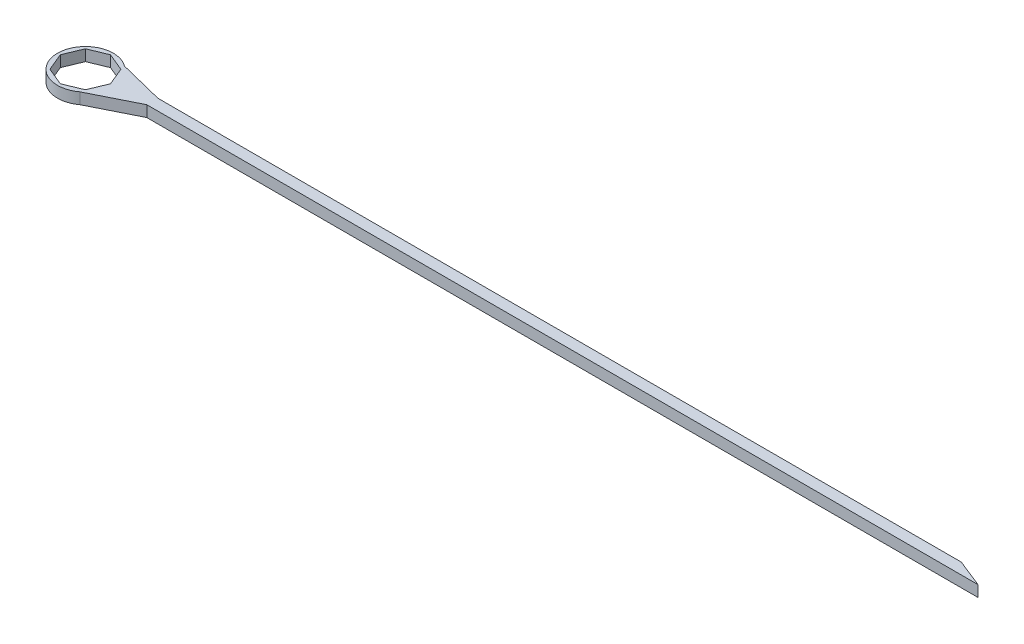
ISO-10303-21;
HEADER;
FILE_DESCRIPTION(('STEP AP214'),'2;1');
FILE_NAME('part.step','',(''),(''),'','','');
FILE_SCHEMA(('AUTOMOTIVE_DESIGN { 1 0 10303 214 1 1 1 1 }'));
ENDSEC;
DATA;
#1=APPLICATION_CONTEXT('core data for automotive mechanical design processes');
#2=APPLICATION_PROTOCOL_DEFINITION('international standard','automotive_design',2000,#1);
#3=PRODUCT_CONTEXT('',#1,'mechanical');
#4=PRODUCT('Part','Part','',(#3));
#5=PRODUCT_RELATED_PRODUCT_CATEGORY('part','',(#4));
#6=PRODUCT_DEFINITION_FORMATION('','',#4);
#7=PRODUCT_DEFINITION_CONTEXT('part definition',#1,'design');
#8=PRODUCT_DEFINITION('design','',#6,#7);
#9=PRODUCT_DEFINITION_SHAPE('','',#8);
#10=(LENGTH_UNIT() NAMED_UNIT(*) SI_UNIT(.MILLI.,.METRE.));
#11=(NAMED_UNIT(*) PLANE_ANGLE_UNIT() SI_UNIT($,.RADIAN.));
#12=(NAMED_UNIT(*) SI_UNIT($,.STERADIAN.) SOLID_ANGLE_UNIT());
#13=UNCERTAINTY_MEASURE_WITH_UNIT(LENGTH_MEASURE(1.E-05),#10,'distance_accuracy_value','');
#14=(GEOMETRIC_REPRESENTATION_CONTEXT(3) GLOBAL_UNCERTAINTY_ASSIGNED_CONTEXT((#13)) GLOBAL_UNIT_ASSIGNED_CONTEXT((#10,
#11,#12)) REPRESENTATION_CONTEXT('',''));
#15=CARTESIAN_POINT('',(0.,0.,0.));
#16=DIRECTION('',(0.,0.,1.));
#17=DIRECTION('',(1.,0.,0.));
#18=AXIS2_PLACEMENT_3D('',#15,#16,#17);
#19=CARTESIAN_POINT('',(0.,1.,0.));
#20=DIRECTION('',(0.,1.,0.));
#21=DIRECTION('',(0.,0.,1.));
#22=AXIS2_PLACEMENT_3D('',#19,#20,#21);
#23=PLANE('',#22);
#24=DIRECTION('',(0.894427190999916,0.,-0.447213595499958));
#25=VECTOR('',#24,1.);
#26=CARTESIAN_POINT('',(5.5,1.,0.));
#27=LINE('',#26,#25);
#28=CARTESIAN_POINT('',(1.5,1.,2.));
#29=VERTEX_POINT('',#28);
#30=CARTESIAN_POINT('',(5.5,1.,0.));
#31=VERTEX_POINT('',#30);
#32=EDGE_CURVE('E198',#29,#31,#27,.T.);
#33=ORIENTED_EDGE('',*,*,#32,.T.);
#34=DIRECTION('',(1.,0.,0.));
#35=VECTOR('',#34,1.);
#36=CARTESIAN_POINT('',(5.5,1.,0.));
#37=LINE('',#36,#35);
#38=CARTESIAN_POINT('',(80.,1.,0.));
#39=VERTEX_POINT('',#38);
#40=EDGE_CURVE('E201',#31,#39,#37,.T.);
#41=ORIENTED_EDGE('',*,*,#40,.T.);
#42=DIRECTION('',(-0.928476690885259,0.,-0.371390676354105));
#43=VECTOR('',#42,1.);
#44=CARTESIAN_POINT('',(80.,1.,0.));
#45=LINE('',#44,#43);
#46=CARTESIAN_POINT('',(77.5,1.,-1.00000000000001));
#47=VERTEX_POINT('',#46);
#48=EDGE_CURVE('E204',#39,#47,#45,.T.);
#49=ORIENTED_EDGE('',*,*,#48,.T.);
#50=DIRECTION('',(-1.,0.,0.));
#51=VECTOR('',#50,1.);
#52=CARTESIAN_POINT('',(77.5,1.,-1.00000000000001));
#53=LINE('',#52,#51);
#54=CARTESIAN_POINT('',(5.5,1.,-0.999999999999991));
#55=VERTEX_POINT('',#54);
#56=EDGE_CURVE('E206',#47,#55,#53,.T.);
#57=ORIENTED_EDGE('',*,*,#56,.T.);
#58=DIRECTION('',(-0.970142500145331,0.,-0.242535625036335));
#59=VECTOR('',#58,1.);
#60=CARTESIAN_POINT('',(5.5,1.,-0.999999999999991));
#61=LINE('',#60,#59);
#62=CARTESIAN_POINT('',(1.5,1.,-2.));
#63=VERTEX_POINT('',#62);
#64=EDGE_CURVE('E208',#55,#63,#61,.T.);
#65=ORIENTED_EDGE('',*,*,#64,.T.);
#66=CARTESIAN_POINT('',(0.,1.,0.));
#67=DIRECTION('',(0.,1.,0.));
#68=DIRECTION('',(0.,0.,1.));
#69=AXIS2_PLACEMENT_3D('',#66,#67,#68);
#70=CIRCLE('',#69,2.5);
#71=EDGE_CURVE('E210',#63,#29,#70,.T.);
#72=ORIENTED_EDGE('',*,*,#71,.T.);
#73=EDGE_LOOP('',(#33,#41,#49,#57,#65,#72));
#74=FACE_BOUND('',#73,.T.);
#75=DIRECTION('',(-0.382683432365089,0.,-0.923879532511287));
#76=VECTOR('',#75,1.);
#77=CARTESIAN_POINT('',(2.25,1.,0.));
#78=LINE('',#77,#76);
#79=CARTESIAN_POINT('',(2.25,1.,0.));
#80=VERTEX_POINT('',#79);
#81=CARTESIAN_POINT('',(1.59099025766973,1.,-1.59099025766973));
#82=VERTEX_POINT('',#81);
#83=EDGE_CURVE('E141',#80,#82,#78,.T.);
#84=ORIENTED_EDGE('',*,*,#83,.F.);
#85=DIRECTION('',(0.38268343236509,0.,-0.923879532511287));
#86=VECTOR('',#85,1.);
#87=CARTESIAN_POINT('',(1.59099025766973,1.,1.59099025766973));
#88=LINE('',#87,#86);
#89=CARTESIAN_POINT('',(1.59099025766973,1.,1.59099025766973));
#90=VERTEX_POINT('',#89);
#91=EDGE_CURVE('E133',#90,#80,#88,.T.);
#92=ORIENTED_EDGE('',*,*,#91,.F.);
#93=DIRECTION('',(0.923879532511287,0.,-0.382683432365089));
#94=VECTOR('',#93,1.);
#95=CARTESIAN_POINT('',(0.,1.,2.25));
#96=LINE('',#95,#94);
#97=CARTESIAN_POINT('',(0.,1.,2.25));
#98=VERTEX_POINT('',#97);
#99=EDGE_CURVE('E166',#98,#90,#96,.T.);
#100=ORIENTED_EDGE('',*,*,#99,.F.);
#101=DIRECTION('',(0.923879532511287,0.,0.38268343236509));
#102=VECTOR('',#101,1.);
#103=CARTESIAN_POINT('',(-1.59099025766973,1.,1.59099025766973));
#104=LINE('',#103,#102);
#105=CARTESIAN_POINT('',(-1.59099025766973,1.,1.59099025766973));
#106=VERTEX_POINT('',#105);
#107=EDGE_CURVE('E164',#106,#98,#104,.T.);
#108=ORIENTED_EDGE('',*,*,#107,.F.);
#109=DIRECTION('',(0.38268343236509,0.,0.923879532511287));
#110=VECTOR('',#109,1.);
#111=CARTESIAN_POINT('',(-2.25,1.,0.));
#112=LINE('',#111,#110);
#113=CARTESIAN_POINT('',(-2.25,1.,0.));
#114=VERTEX_POINT('',#113);
#115=EDGE_CURVE('E162',#114,#106,#112,.T.);
#116=ORIENTED_EDGE('',*,*,#115,.F.);
#117=DIRECTION('',(-0.38268343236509,0.,0.923879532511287));
#118=VECTOR('',#117,1.);
#119=CARTESIAN_POINT('',(-1.59099025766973,1.,-1.59099025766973));
#120=LINE('',#119,#118);
#121=CARTESIAN_POINT('',(-1.59099025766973,1.,-1.59099025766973));
#122=VERTEX_POINT('',#121);
#123=EDGE_CURVE('E160',#122,#114,#120,.T.);
#124=ORIENTED_EDGE('',*,*,#123,.F.);
#125=DIRECTION('',(-0.923879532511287,0.,0.382683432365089));
#126=VECTOR('',#125,1.);
#127=CARTESIAN_POINT('',(0.,1.,-2.25));
#128=LINE('',#127,#126);
#129=CARTESIAN_POINT('',(0.,1.,-2.25));
#130=VERTEX_POINT('',#129);
#131=EDGE_CURVE('E156',#130,#122,#128,.T.);
#132=ORIENTED_EDGE('',*,*,#131,.F.);
#133=DIRECTION('',(-0.923879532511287,0.,-0.38268343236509));
#134=VECTOR('',#133,1.);
#135=CARTESIAN_POINT('',(1.59099025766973,1.,-1.59099025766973));
#136=LINE('',#135,#134);
#137=EDGE_CURVE('E154',#82,#130,#136,.T.);
#138=ORIENTED_EDGE('',*,*,#137,.F.);
#139=EDGE_LOOP('',(#84,#92,#100,#108,#116,#124,#132,#138));
#140=FACE_BOUND('',#139,.T.);
#141=ADVANCED_FACE('F32',(#74,#140),#23,.T.);
#142=CARTESIAN_POINT('',(0.,0.,0.));
#143=DIRECTION('',(0.,1.,0.));
#144=DIRECTION('',(0.,0.,1.));
#145=AXIS2_PLACEMENT_3D('',#142,#143,#144);
#146=PLANE('',#145);
#147=DIRECTION('',(0.894427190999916,0.,-0.447213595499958));
#148=VECTOR('',#147,1.);
#149=CARTESIAN_POINT('',(5.5,0.,0.));
#150=LINE('',#149,#148);
#151=CARTESIAN_POINT('',(1.5,0.,2.));
#152=VERTEX_POINT('',#151);
#153=CARTESIAN_POINT('',(5.5,0.,0.));
#154=VERTEX_POINT('',#153);
#155=EDGE_CURVE('E149',#152,#154,#150,.T.);
#156=ORIENTED_EDGE('',*,*,#155,.F.);
#157=CARTESIAN_POINT('',(0.,0.,0.));
#158=DIRECTION('',(0.,1.,0.));
#159=DIRECTION('',(0.,0.,1.));
#160=AXIS2_PLACEMENT_3D('',#157,#158,#159);
#161=CIRCLE('',#160,2.5);
#162=CARTESIAN_POINT('',(1.5,0.,-2.));
#163=VERTEX_POINT('',#162);
#164=EDGE_CURVE('E202',#163,#152,#161,.T.);
#165=ORIENTED_EDGE('',*,*,#164,.F.);
#166=DIRECTION('',(-0.970142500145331,0.,-0.242535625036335));
#167=VECTOR('',#166,1.);
#168=CARTESIAN_POINT('',(5.5,0.,-0.999999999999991));
#169=LINE('',#168,#167);
#170=CARTESIAN_POINT('',(5.5,0.,-0.999999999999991));
#171=VERTEX_POINT('',#170);
#172=EDGE_CURVE('E221',#171,#163,#169,.T.);
#173=ORIENTED_EDGE('',*,*,#172,.F.);
#174=DIRECTION('',(-1.,0.,0.));
#175=VECTOR('',#174,1.);
#176=CARTESIAN_POINT('',(77.5,0.,-1.00000000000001));
#177=LINE('',#176,#175);
#178=CARTESIAN_POINT('',(77.5,0.,-1.00000000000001));
#179=VERTEX_POINT('',#178);
#180=EDGE_CURVE('E219',#179,#171,#177,.T.);
#181=ORIENTED_EDGE('',*,*,#180,.F.);
#182=DIRECTION('',(-0.928476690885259,0.,-0.371390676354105));
#183=VECTOR('',#182,1.);
#184=CARTESIAN_POINT('',(80.,0.,0.));
#185=LINE('',#184,#183);
#186=CARTESIAN_POINT('',(80.,0.,0.));
#187=VERTEX_POINT('',#186);
#188=EDGE_CURVE('E217',#187,#179,#185,.T.);
#189=ORIENTED_EDGE('',*,*,#188,.F.);
#190=DIRECTION('',(1.,0.,0.));
#191=VECTOR('',#190,1.);
#192=CARTESIAN_POINT('',(5.5,0.,0.));
#193=LINE('',#192,#191);
#194=EDGE_CURVE('E215',#154,#187,#193,.T.);
#195=ORIENTED_EDGE('',*,*,#194,.F.);
#196=EDGE_LOOP('',(#156,#165,#173,#181,#189,#195));
#197=FACE_BOUND('',#196,.T.);
#198=DIRECTION('',(0.38268343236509,0.,-0.923879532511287));
#199=VECTOR('',#198,1.);
#200=CARTESIAN_POINT('',(1.59099025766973,0.,1.59099025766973));
#201=LINE('',#200,#199);
#202=CARTESIAN_POINT('',(1.59099025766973,0.,1.59099025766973));
#203=VERTEX_POINT('',#202);
#204=CARTESIAN_POINT('',(2.25,0.,0.));
#205=VERTEX_POINT('',#204);
#206=EDGE_CURVE('E55',#203,#205,#201,.T.);
#207=ORIENTED_EDGE('',*,*,#206,.T.);
#208=DIRECTION('',(-0.382683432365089,0.,-0.923879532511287));
#209=VECTOR('',#208,1.);
#210=CARTESIAN_POINT('',(2.25,0.,0.));
#211=LINE('',#210,#209);
#212=CARTESIAN_POINT('',(1.59099025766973,0.,-1.59099025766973));
#213=VERTEX_POINT('',#212);
#214=EDGE_CURVE('E148',#205,#213,#211,.T.);
#215=ORIENTED_EDGE('',*,*,#214,.T.);
#216=DIRECTION('',(-0.923879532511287,0.,-0.38268343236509));
#217=VECTOR('',#216,1.);
#218=CARTESIAN_POINT('',(1.59099025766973,0.,-1.59099025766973));
#219=LINE('',#218,#217);
#220=CARTESIAN_POINT('',(0.,0.,-2.25));
#221=VERTEX_POINT('',#220);
#222=EDGE_CURVE('E170',#213,#221,#219,.T.);
#223=ORIENTED_EDGE('',*,*,#222,.T.);
#224=DIRECTION('',(-0.923879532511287,0.,0.382683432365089));
#225=VECTOR('',#224,1.);
#226=CARTESIAN_POINT('',(0.,0.,-2.25));
#227=LINE('',#226,#225);
#228=CARTESIAN_POINT('',(-1.59099025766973,0.,-1.59099025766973));
#229=VERTEX_POINT('',#228);
#230=EDGE_CURVE('E173',#221,#229,#227,.T.);
#231=ORIENTED_EDGE('',*,*,#230,.T.);
#232=DIRECTION('',(-0.38268343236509,0.,0.923879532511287));
#233=VECTOR('',#232,1.);
#234=CARTESIAN_POINT('',(-1.59099025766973,0.,-1.59099025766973));
#235=LINE('',#234,#233);
#236=CARTESIAN_POINT('',(-2.25,0.,0.));
#237=VERTEX_POINT('',#236);
#238=EDGE_CURVE('E176',#229,#237,#235,.T.);
#239=ORIENTED_EDGE('',*,*,#238,.T.);
#240=DIRECTION('',(0.38268343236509,0.,0.923879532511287));
#241=VECTOR('',#240,1.);
#242=CARTESIAN_POINT('',(-2.25,0.,0.));
#243=LINE('',#242,#241);
#244=CARTESIAN_POINT('',(-1.59099025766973,0.,1.59099025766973));
#245=VERTEX_POINT('',#244);
#246=EDGE_CURVE('E179',#237,#245,#243,.T.);
#247=ORIENTED_EDGE('',*,*,#246,.T.);
#248=DIRECTION('',(0.923879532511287,0.,0.38268343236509));
#249=VECTOR('',#248,1.);
#250=CARTESIAN_POINT('',(-1.59099025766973,0.,1.59099025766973));
#251=LINE('',#250,#249);
#252=CARTESIAN_POINT('',(0.,0.,2.25));
#253=VERTEX_POINT('',#252);
#254=EDGE_CURVE('E182',#245,#253,#251,.T.);
#255=ORIENTED_EDGE('',*,*,#254,.T.);
#256=DIRECTION('',(0.923879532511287,0.,-0.382683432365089));
#257=VECTOR('',#256,1.);
#258=CARTESIAN_POINT('',(0.,0.,2.25));
#259=LINE('',#258,#257);
#260=EDGE_CURVE('E142',#253,#203,#259,.T.);
#261=ORIENTED_EDGE('',*,*,#260,.T.);
#262=EDGE_LOOP('',(#207,#215,#223,#231,#239,#247,#255,#261));
#263=FACE_BOUND('',#262,.T.);
#264=ADVANCED_FACE('F245',(#197,#263),#146,.F.);
#265=CARTESIAN_POINT('',(5.5,1.,0.));
#266=DIRECTION('',(-0.447213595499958,0.,-0.894427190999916));
#267=DIRECTION('',(-0.894427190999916,0.,0.447213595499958));
#268=AXIS2_PLACEMENT_3D('',#265,#266,#267);
#269=PLANE('',#268);
#270=ORIENTED_EDGE('',*,*,#155,.T.);
#271=DIRECTION('',(0.,-1.,0.));
#272=VECTOR('',#271,1.);
#273=CARTESIAN_POINT('',(5.5,1.,0.));
#274=LINE('',#273,#272);
#275=EDGE_CURVE('E11',#31,#154,#274,.T.);
#276=ORIENTED_EDGE('',*,*,#275,.F.);
#277=ORIENTED_EDGE('',*,*,#32,.F.);
#278=DIRECTION('',(0.,-1.,0.));
#279=VECTOR('',#278,1.);
#280=CARTESIAN_POINT('',(1.5,1.,2.));
#281=LINE('',#280,#279);
#282=EDGE_CURVE('E212',#29,#152,#281,.T.);
#283=ORIENTED_EDGE('',*,*,#282,.T.);
#284=EDGE_LOOP('',(#270,#276,#277,#283));
#285=FACE_BOUND('',#284,.T.);
#286=ADVANCED_FACE('F34',(#285),#269,.F.);
#287=CARTESIAN_POINT('',(5.5,1.,0.));
#288=DIRECTION('',(0.,0.,-1.));
#289=DIRECTION('',(-1.,0.,0.));
#290=AXIS2_PLACEMENT_3D('',#287,#288,#289);
#291=PLANE('',#290);
#292=ORIENTED_EDGE('',*,*,#194,.T.);
#293=DIRECTION('',(0.,-1.,0.));
#294=VECTOR('',#293,1.);
#295=CARTESIAN_POINT('',(80.,1.,0.));
#296=LINE('',#295,#294);
#297=EDGE_CURVE('E40',#39,#187,#296,.T.);
#298=ORIENTED_EDGE('',*,*,#297,.F.);
#299=ORIENTED_EDGE('',*,*,#40,.F.);
#300=ORIENTED_EDGE('',*,*,#275,.T.);
#301=EDGE_LOOP('',(#292,#298,#299,#300));
#302=FACE_BOUND('',#301,.T.);
#303=ADVANCED_FACE('F262',(#302),#291,.F.);
#304=CARTESIAN_POINT('',(80.,1.,0.));
#305=DIRECTION('',(-0.371390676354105,0.,0.928476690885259));
#306=DIRECTION('',(0.928476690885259,0.,0.371390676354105));
#307=AXIS2_PLACEMENT_3D('',#304,#305,#306);
#308=PLANE('',#307);
#309=ORIENTED_EDGE('',*,*,#188,.T.);
#310=DIRECTION('',(0.,-1.,0.));
#311=VECTOR('',#310,1.);
#312=CARTESIAN_POINT('',(77.5,1.,-1.00000000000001));
#313=LINE('',#312,#311);
#314=EDGE_CURVE('E232',#47,#179,#313,.T.);
#315=ORIENTED_EDGE('',*,*,#314,.F.);
#316=ORIENTED_EDGE('',*,*,#48,.F.);
#317=ORIENTED_EDGE('',*,*,#297,.T.);
#318=EDGE_LOOP('',(#309,#315,#316,#317));
#319=FACE_BOUND('',#318,.T.);
#320=ADVANCED_FACE('F239',(#319),#308,.F.);
#321=CARTESIAN_POINT('',(77.5,1.,-1.00000000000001));
#322=DIRECTION('',(0.,0.,1.));
#323=DIRECTION('',(1.,0.,0.));
#324=AXIS2_PLACEMENT_3D('',#321,#322,#323);
#325=PLANE('',#324);
#326=ORIENTED_EDGE('',*,*,#180,.T.);
#327=DIRECTION('',(0.,-1.,0.));
#328=VECTOR('',#327,1.);
#329=CARTESIAN_POINT('',(5.5,1.,-0.999999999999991));
#330=LINE('',#329,#328);
#331=EDGE_CURVE('E229',#55,#171,#330,.T.);
#332=ORIENTED_EDGE('',*,*,#331,.F.);
#333=ORIENTED_EDGE('',*,*,#56,.F.);
#334=ORIENTED_EDGE('',*,*,#314,.T.);
#335=EDGE_LOOP('',(#326,#332,#333,#334));
#336=FACE_BOUND('',#335,.T.);
#337=ADVANCED_FACE('F251',(#336),#325,.F.);
#338=CARTESIAN_POINT('',(5.5,1.,-0.999999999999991));
#339=DIRECTION('',(-0.242535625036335,0.,0.970142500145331));
#340=DIRECTION('',(0.970142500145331,0.,0.242535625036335));
#341=AXIS2_PLACEMENT_3D('',#338,#339,#340);
#342=PLANE('',#341);
#343=ORIENTED_EDGE('',*,*,#172,.T.);
#344=DIRECTION('',(0.,-1.,0.));
#345=VECTOR('',#344,1.);
#346=CARTESIAN_POINT('',(1.5,1.,-2.));
#347=LINE('',#346,#345);
#348=EDGE_CURVE('E226',#63,#163,#347,.T.);
#349=ORIENTED_EDGE('',*,*,#348,.F.);
#350=ORIENTED_EDGE('',*,*,#64,.F.);
#351=ORIENTED_EDGE('',*,*,#331,.T.);
#352=EDGE_LOOP('',(#343,#349,#350,#351));
#353=FACE_BOUND('',#352,.T.);
#354=ADVANCED_FACE('F255',(#353),#342,.F.);
#355=CARTESIAN_POINT('',(0.,1.,0.));
#356=DIRECTION('',(0.,-1.,0.));
#357=DIRECTION('',(0.,0.,-1.));
#358=AXIS2_PLACEMENT_3D('',#355,#356,#357);
#359=CYLINDRICAL_SURFACE('',#358,2.5);
#360=ORIENTED_EDGE('',*,*,#164,.T.);
#361=ORIENTED_EDGE('',*,*,#282,.F.);
#362=ORIENTED_EDGE('',*,*,#71,.F.);
#363=ORIENTED_EDGE('',*,*,#348,.T.);
#364=EDGE_LOOP('',(#360,#361,#362,#363));
#365=FACE_BOUND('',#364,.T.);
#366=ADVANCED_FACE('F265',(#365),#359,.T.);
#367=CARTESIAN_POINT('',(1.59099025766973,1.,1.59099025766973));
#368=DIRECTION('',(-0.923879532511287,0.,-0.38268343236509));
#369=DIRECTION('',(-0.38268343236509,0.,0.923879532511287));
#370=AXIS2_PLACEMENT_3D('',#367,#368,#369);
#371=PLANE('',#370);
#372=ORIENTED_EDGE('',*,*,#206,.F.);
#373=DIRECTION('',(0.,-1.,0.));
#374=VECTOR('',#373,1.);
#375=CARTESIAN_POINT('',(1.59099025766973,1.,1.59099025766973));
#376=LINE('',#375,#374);
#377=EDGE_CURVE('E137',#90,#203,#376,.T.);
#378=ORIENTED_EDGE('',*,*,#377,.F.);
#379=ORIENTED_EDGE('',*,*,#91,.T.);
#380=DIRECTION('',(0.,-1.,0.));
#381=VECTOR('',#380,1.);
#382=CARTESIAN_POINT('',(2.25,1.,0.));
#383=LINE('',#382,#381);
#384=EDGE_CURVE('E136',#80,#205,#383,.T.);
#385=ORIENTED_EDGE('',*,*,#384,.T.);
#386=EDGE_LOOP('',(#372,#378,#379,#385));
#387=FACE_BOUND('',#386,.T.);
#388=ADVANCED_FACE('F135',(#387),#371,.T.);
#389=CARTESIAN_POINT('',(2.25,1.,0.));
#390=DIRECTION('',(-0.923879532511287,0.,0.382683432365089));
#391=DIRECTION('',(0.382683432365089,0.,0.923879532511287));
#392=AXIS2_PLACEMENT_3D('',#389,#390,#391);
#393=PLANE('',#392);
#394=ORIENTED_EDGE('',*,*,#214,.F.);
#395=ORIENTED_EDGE('',*,*,#384,.F.);
#396=ORIENTED_EDGE('',*,*,#83,.T.);
#397=DIRECTION('',(0.,-1.,0.));
#398=VECTOR('',#397,1.);
#399=CARTESIAN_POINT('',(1.59099025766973,1.,-1.59099025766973));
#400=LINE('',#399,#398);
#401=EDGE_CURVE('E150',#82,#213,#400,.T.);
#402=ORIENTED_EDGE('',*,*,#401,.T.);
#403=EDGE_LOOP('',(#394,#395,#396,#402));
#404=FACE_BOUND('',#403,.T.);
#405=ADVANCED_FACE('F145',(#404),#393,.T.);
#406=CARTESIAN_POINT('',(1.59099025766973,1.,-1.59099025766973));
#407=DIRECTION('',(-0.38268343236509,0.,0.923879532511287));
#408=DIRECTION('',(0.923879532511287,0.,0.38268343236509));
#409=AXIS2_PLACEMENT_3D('',#406,#407,#408);
#410=PLANE('',#409);
#411=ORIENTED_EDGE('',*,*,#222,.F.);
#412=ORIENTED_EDGE('',*,*,#401,.F.);
#413=ORIENTED_EDGE('',*,*,#137,.T.);
#414=DIRECTION('',(0.,-1.,0.));
#415=VECTOR('',#414,1.);
#416=CARTESIAN_POINT('',(0.,1.,-2.25));
#417=LINE('',#416,#415);
#418=EDGE_CURVE('E195',#130,#221,#417,.T.);
#419=ORIENTED_EDGE('',*,*,#418,.T.);
#420=EDGE_LOOP('',(#411,#412,#413,#419));
#421=FACE_BOUND('',#420,.T.);
#422=ADVANCED_FACE('F283',(#421),#410,.T.);
#423=CARTESIAN_POINT('',(0.,1.,-2.25));
#424=DIRECTION('',(0.382683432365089,0.,0.923879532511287));
#425=DIRECTION('',(0.923879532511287,0.,-0.382683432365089));
#426=AXIS2_PLACEMENT_3D('',#423,#424,#425);
#427=PLANE('',#426);
#428=ORIENTED_EDGE('',*,*,#230,.F.);
#429=ORIENTED_EDGE('',*,*,#418,.F.);
#430=ORIENTED_EDGE('',*,*,#131,.T.);
#431=DIRECTION('',(0.,-1.,0.));
#432=VECTOR('',#431,1.);
#433=CARTESIAN_POINT('',(-1.59099025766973,1.,-1.59099025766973));
#434=LINE('',#433,#432);
#435=EDGE_CURVE('E193',#122,#229,#434,.T.);
#436=ORIENTED_EDGE('',*,*,#435,.T.);
#437=EDGE_LOOP('',(#428,#429,#430,#436));
#438=FACE_BOUND('',#437,.T.);
#439=ADVANCED_FACE('F286',(#438),#427,.T.);
#440=CARTESIAN_POINT('',(-1.59099025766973,1.,-1.59099025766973));
#441=DIRECTION('',(0.923879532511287,0.,0.38268343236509));
#442=DIRECTION('',(0.38268343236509,0.,-0.923879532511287));
#443=AXIS2_PLACEMENT_3D('',#440,#441,#442);
#444=PLANE('',#443);
#445=ORIENTED_EDGE('',*,*,#238,.F.);
#446=ORIENTED_EDGE('',*,*,#435,.F.);
#447=ORIENTED_EDGE('',*,*,#123,.T.);
#448=DIRECTION('',(0.,-1.,0.));
#449=VECTOR('',#448,1.);
#450=CARTESIAN_POINT('',(-2.25,1.,0.));
#451=LINE('',#450,#449);
#452=EDGE_CURVE('E191',#114,#237,#451,.T.);
#453=ORIENTED_EDGE('',*,*,#452,.T.);
#454=EDGE_LOOP('',(#445,#446,#447,#453));
#455=FACE_BOUND('',#454,.T.);
#456=ADVANCED_FACE('F290',(#455),#444,.T.);
#457=CARTESIAN_POINT('',(-2.25,1.,0.));
#458=DIRECTION('',(0.923879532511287,0.,-0.38268343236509));
#459=DIRECTION('',(-0.38268343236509,0.,-0.923879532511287));
#460=AXIS2_PLACEMENT_3D('',#457,#458,#459);
#461=PLANE('',#460);
#462=ORIENTED_EDGE('',*,*,#246,.F.);
#463=ORIENTED_EDGE('',*,*,#452,.F.);
#464=ORIENTED_EDGE('',*,*,#115,.T.);
#465=DIRECTION('',(0.,-1.,0.));
#466=VECTOR('',#465,1.);
#467=CARTESIAN_POINT('',(-1.59099025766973,1.,1.59099025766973));
#468=LINE('',#467,#466);
#469=EDGE_CURVE('E189',#106,#245,#468,.T.);
#470=ORIENTED_EDGE('',*,*,#469,.T.);
#471=EDGE_LOOP('',(#462,#463,#464,#470));
#472=FACE_BOUND('',#471,.T.);
#473=ADVANCED_FACE('F294',(#472),#461,.T.);
#474=CARTESIAN_POINT('',(-1.59099025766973,1.,1.59099025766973));
#475=DIRECTION('',(0.38268343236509,0.,-0.923879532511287));
#476=DIRECTION('',(-0.923879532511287,0.,-0.38268343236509));
#477=AXIS2_PLACEMENT_3D('',#474,#475,#476);
#478=PLANE('',#477);
#479=ORIENTED_EDGE('',*,*,#254,.F.);
#480=ORIENTED_EDGE('',*,*,#469,.F.);
#481=ORIENTED_EDGE('',*,*,#107,.T.);
#482=DIRECTION('',(0.,-1.,0.));
#483=VECTOR('',#482,1.);
#484=CARTESIAN_POINT('',(0.,1.,2.25));
#485=LINE('',#484,#483);
#486=EDGE_CURVE('E47',#98,#253,#485,.T.);
#487=ORIENTED_EDGE('',*,*,#486,.T.);
#488=EDGE_LOOP('',(#479,#480,#481,#487));
#489=FACE_BOUND('',#488,.T.);
#490=ADVANCED_FACE('F298',(#489),#478,.T.);
#491=CARTESIAN_POINT('',(0.,1.,2.25));
#492=DIRECTION('',(-0.382683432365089,0.,-0.923879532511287));
#493=DIRECTION('',(-0.923879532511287,0.,0.382683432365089));
#494=AXIS2_PLACEMENT_3D('',#491,#492,#493);
#495=PLANE('',#494);
#496=ORIENTED_EDGE('',*,*,#260,.F.);
#497=ORIENTED_EDGE('',*,*,#486,.F.);
#498=ORIENTED_EDGE('',*,*,#99,.T.);
#499=ORIENTED_EDGE('',*,*,#377,.T.);
#500=EDGE_LOOP('',(#496,#497,#498,#499));
#501=FACE_BOUND('',#500,.T.);
#502=ADVANCED_FACE('F302',(#501),#495,.T.);
#503=CLOSED_SHELL('',(#141,#264,#286,#303,#320,#337,#354,#366,#388,#405,#422,#439,#456,#473,
#490,#502));
#504=MANIFOLD_SOLID_BREP('B2',#503);
#505=ADVANCED_BREP_SHAPE_REPRESENTATION('',(#18,#504),#14);
#506=SHAPE_DEFINITION_REPRESENTATION(#9,#505);
ENDSEC;
END-ISO-10303-21;
